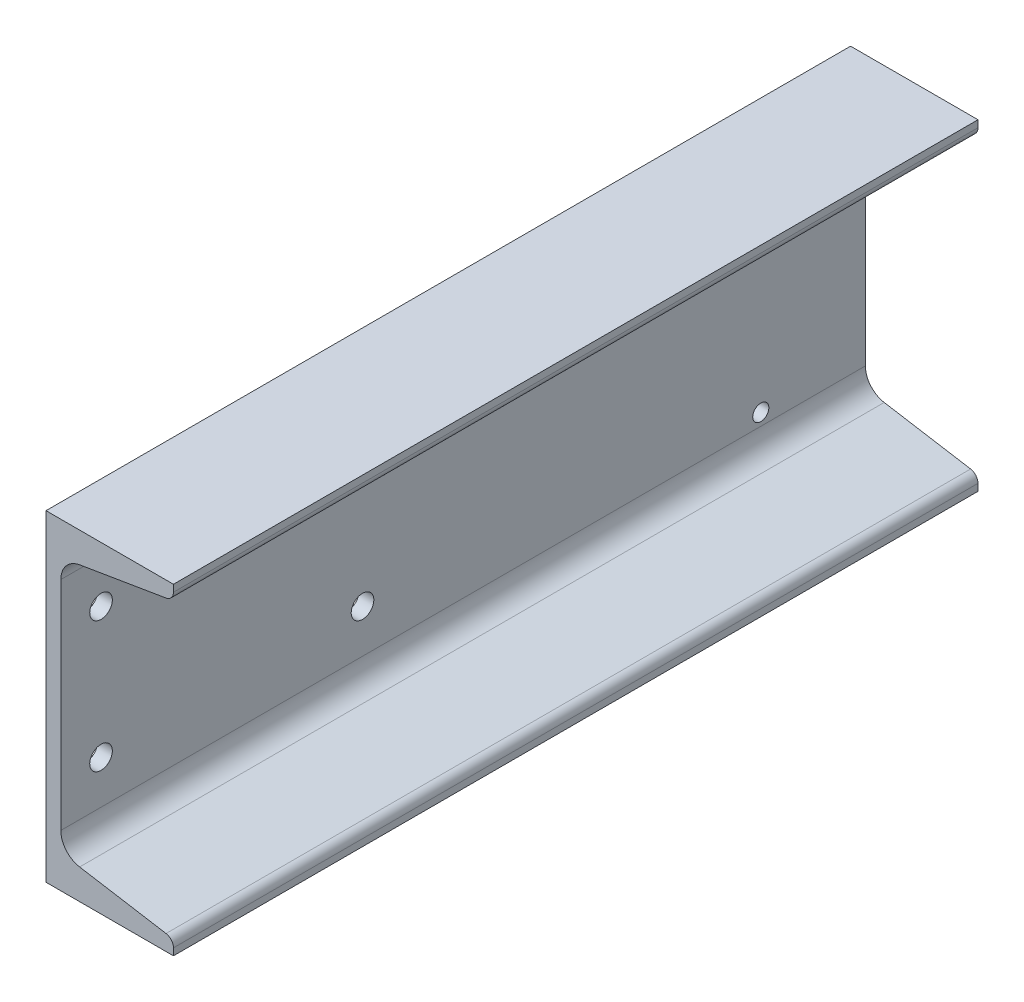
from build123d import *

# Parameters (mm, degrees)
BASE_EXTRUDE_DEPTH = 254
SKETCH2_R          = 3.5687
CUT_EXTRUDE1_DEPTH = 277.638666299
SKETCH3_R          = 3.5687
CUT_EXTRUDE2_DEPTH = 277.638666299
SKETCH4_R          = 3.5687
CUT_EXTRUDE3_DEPTH = 277.638666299
SKETCH5_R          = 3.5687
CUT_EXTRUDE4_DEPTH = 277.638666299
SKETCH6_R          = 2.54
CUT_EXTRUDE5_DEPTH = 277.638666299


with BuildPart() as part:
    # Sketch1 → Base-Extrude (new body)
    with BuildSketch(Plane.XY):
        with BuildLine():
            Line((0, 0.351994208), (0, 101.951994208))
            Line((0, 101.951994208), (40.2336, 101.951994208))
            Line((40.2336, 101.951994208), (40.2336, 99.763988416))
            ThreePointArc((40.2336, 99.763988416), (39.571488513, 97.958029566), (37.898963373, 97.008009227))
            Line((37.898963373, 97.008009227), (10.616311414, 92.460568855))
            ThreePointArc((10.616311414, 92.460568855), (6.358974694, 90.042335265), (4.6736, 85.445349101))
            Line((4.6736, 85.445349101), (4.6736, 16.858639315))
            ThreePointArc((4.6736, 16.858639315), (6.358974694, 12.261653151), (10.616311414, 9.84341956))
            Line((10.616311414, 9.84341956), (37.898963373, 5.295979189))
            ThreePointArc((37.898963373, 5.295979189), (39.571488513, 4.34595885), (40.2336, 2.54))
            Line((40.2336, 2.54), (40.2336, 0.351994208))
            Line((40.2336, 0.351994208), (0, 0.351994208))
        make_face()
    extrude(amount=BASE_EXTRUDE_DEPTH)

    # Sketch2 → Cut-Extrude1 (cut, through all)
    with BuildSketch(Plane.ZY):
        with Locations(Location((158.75, 71.776794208, 0), (0, 0, 270))):
            Circle(SKETCH2_R)
    extrude(amount=-CUT_EXTRUDE1_DEPTH, mode=Mode.SUBTRACT)

    # Sketch3 → Cut-Extrude2 (cut, through all)
    with BuildSketch(Plane.ZY):
        with Locations(Location((241.3, 71.776794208, 0), (0, 0, 270))):
            Circle(SKETCH3_R)
    extrude(amount=-CUT_EXTRUDE2_DEPTH, mode=Mode.SUBTRACT)

    # Sketch4 → Cut-Extrude3 (cut, through all)
    with BuildSketch(Plane.ZY):
        with Locations(Location((158.75, 30.501794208, 0), (0, 0, 270))):
            Circle(SKETCH4_R)
    extrude(amount=-CUT_EXTRUDE3_DEPTH, mode=Mode.SUBTRACT)

    # Sketch5 → Cut-Extrude4 (cut, through all)
    with BuildSketch(Plane.ZY):
        with Locations(Location((241.3, 30.501794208, 0), (0, 0, 270))):
            Circle(SKETCH5_R)
    extrude(amount=-CUT_EXTRUDE4_DEPTH, mode=Mode.SUBTRACT)

    # Sketch6 → Cut-Extrude5 (cut, through all)
    with BuildSketch(Plane.ZY):
        with Locations(Location((33.02, 81.631994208, 0), (0, 0, 270))):
            Circle(SKETCH6_R)
        with Locations(Location((33.02, 20.671994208, 0), (0, 0, 270))):
            Circle(SKETCH6_R)
    extrude(amount=-CUT_EXTRUDE5_DEPTH, mode=Mode.SUBTRACT)


solid = part.part
